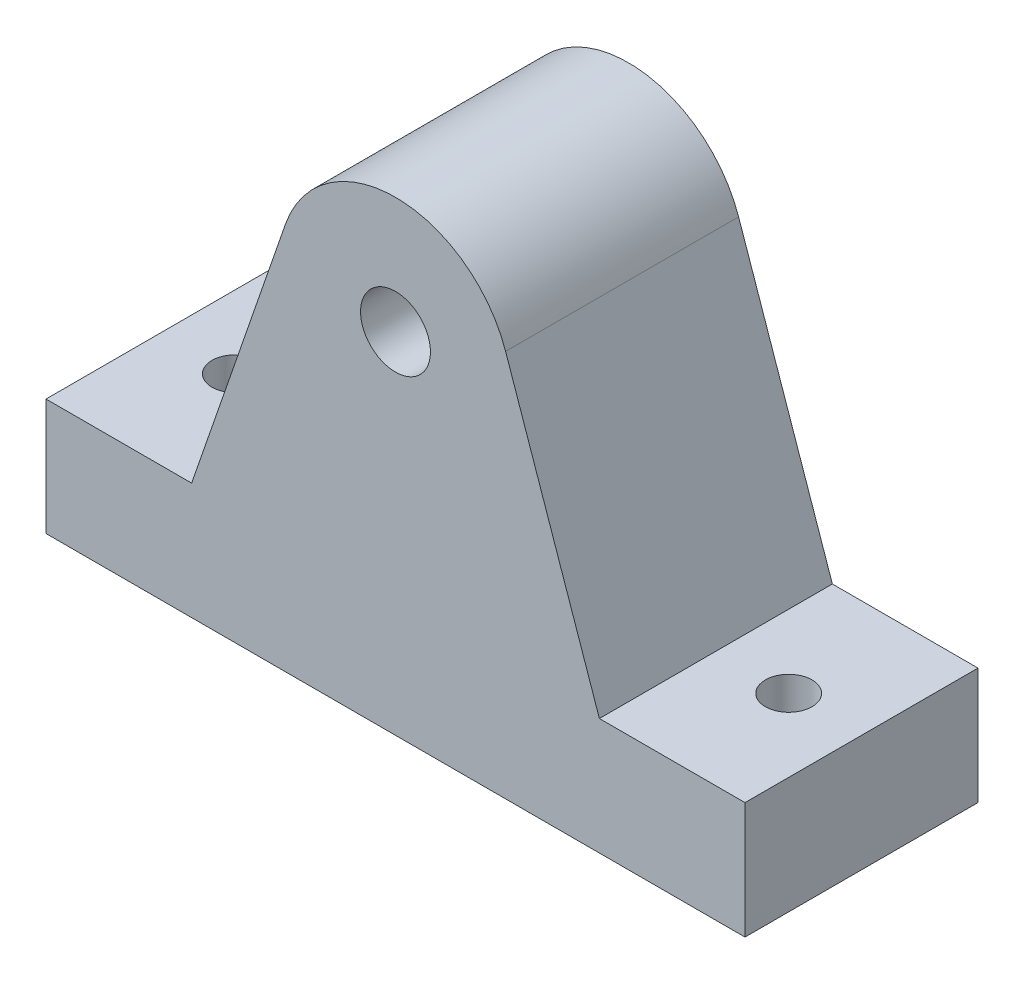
ISO-10303-21;
HEADER;
FILE_DESCRIPTION(('STEP AP214'),'2;1');
FILE_NAME('part.step','',(''),(''),'','','');
FILE_SCHEMA(('AUTOMOTIVE_DESIGN { 1 0 10303 214 1 1 1 1 }'));
ENDSEC;
DATA;
#1=APPLICATION_CONTEXT('core data for automotive mechanical design processes');
#2=APPLICATION_PROTOCOL_DEFINITION('international standard','automotive_design',2000,#1);
#3=PRODUCT_CONTEXT('',#1,'mechanical');
#4=PRODUCT('Part','Part','',(#3));
#5=PRODUCT_RELATED_PRODUCT_CATEGORY('part','',(#4));
#6=PRODUCT_DEFINITION_FORMATION('','',#4);
#7=PRODUCT_DEFINITION_CONTEXT('part definition',#1,'design');
#8=PRODUCT_DEFINITION('design','',#6,#7);
#9=PRODUCT_DEFINITION_SHAPE('','',#8);
#10=(LENGTH_UNIT() NAMED_UNIT(*) SI_UNIT(.MILLI.,.METRE.));
#11=(NAMED_UNIT(*) PLANE_ANGLE_UNIT() SI_UNIT($,.RADIAN.));
#12=(NAMED_UNIT(*) SI_UNIT($,.STERADIAN.) SOLID_ANGLE_UNIT());
#13=UNCERTAINTY_MEASURE_WITH_UNIT(LENGTH_MEASURE(1.E-05),#10,'distance_accuracy_value','');
#14=(GEOMETRIC_REPRESENTATION_CONTEXT(3) GLOBAL_UNCERTAINTY_ASSIGNED_CONTEXT((#13)) GLOBAL_UNIT_ASSIGNED_CONTEXT((#10,
#11,#12)) REPRESENTATION_CONTEXT('',''));
#15=CARTESIAN_POINT('',(0.,0.,0.));
#16=DIRECTION('',(0.,0.,1.));
#17=DIRECTION('',(1.,0.,0.));
#18=AXIS2_PLACEMENT_3D('',#15,#16,#17);
#19=CARTESIAN_POINT('',(0.,30.,20.));
#20=DIRECTION('',(0.,0.,1.));
#21=DIRECTION('',(1.,0.,0.));
#22=AXIS2_PLACEMENT_3D('',#19,#20,#21);
#23=PLANE('',#22);
#24=DIRECTION('',(-1.,0.,0.));
#25=VECTOR('',#24,1.);
#26=CARTESIAN_POINT('',(-30.,10.,20.));
#27=LINE('',#26,#25);
#28=CARTESIAN_POINT('',(-17.5,10.,20.));
#29=VERTEX_POINT('',#28);
#30=CARTESIAN_POINT('',(-30.,10.,20.));
#31=VERTEX_POINT('',#30);
#32=EDGE_CURVE('E145',#29,#31,#27,.T.);
#33=ORIENTED_EDGE('',*,*,#32,.T.);
#34=DIRECTION('',(0.,-1.,0.));
#35=VECTOR('',#34,1.);
#36=CARTESIAN_POINT('',(-30.,0.,20.));
#37=LINE('',#36,#35);
#38=CARTESIAN_POINT('',(-30.,0.,20.));
#39=VERTEX_POINT('',#38);
#40=EDGE_CURVE('E93',#31,#39,#37,.T.);
#41=ORIENTED_EDGE('',*,*,#40,.T.);
#42=DIRECTION('',(1.,0.,0.));
#43=VECTOR('',#42,1.);
#44=CARTESIAN_POINT('',(-30.,0.,20.));
#45=LINE('',#44,#43);
#46=CARTESIAN_POINT('',(30.,0.,20.));
#47=VERTEX_POINT('',#46);
#48=EDGE_CURVE('E160',#39,#47,#45,.T.);
#49=ORIENTED_EDGE('',*,*,#48,.T.);
#50=DIRECTION('',(0.,1.,0.));
#51=VECTOR('',#50,1.);
#52=CARTESIAN_POINT('',(30.,0.,20.));
#53=LINE('',#52,#51);
#54=CARTESIAN_POINT('',(30.,10.,20.));
#55=VERTEX_POINT('',#54);
#56=EDGE_CURVE('E173',#47,#55,#53,.T.);
#57=ORIENTED_EDGE('',*,*,#56,.T.);
#58=DIRECTION('',(-1.,0.,0.));
#59=VECTOR('',#58,1.);
#60=CARTESIAN_POINT('',(30.,10.,20.));
#61=LINE('',#60,#59);
#62=CARTESIAN_POINT('',(17.5,10.,20.));
#63=VERTEX_POINT('',#62);
#64=EDGE_CURVE('E112',#55,#63,#61,.T.);
#65=ORIENTED_EDGE('',*,*,#64,.T.);
#66=DIRECTION('',(-0.326920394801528,0.945051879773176,0.));
#67=VECTOR('',#66,1.);
#68=CARTESIAN_POINT('',(17.5,10.,20.));
#69=LINE('',#68,#67);
#70=CARTESIAN_POINT('',(9.45051879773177,33.2692039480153,20.));
#71=VERTEX_POINT('',#70);
#72=EDGE_CURVE('E106',#63,#71,#69,.T.);
#73=ORIENTED_EDGE('',*,*,#72,.T.);
#74=CARTESIAN_POINT('',(0.,30.,20.));
#75=DIRECTION('',(0.,0.,1.));
#76=DIRECTION('',(1.,0.,0.));
#77=AXIS2_PLACEMENT_3D('',#74,#75,#76);
#78=CIRCLE('',#77,10.);
#79=CARTESIAN_POINT('',(-9.45051879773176,33.2692039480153,20.));
#80=VERTEX_POINT('',#79);
#81=EDGE_CURVE('E110',#71,#80,#78,.T.);
#82=ORIENTED_EDGE('',*,*,#81,.T.);
#83=DIRECTION('',(-0.326920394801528,-0.945051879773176,0.));
#84=VECTOR('',#83,1.);
#85=CARTESIAN_POINT('',(-17.5,10.,20.));
#86=LINE('',#85,#84);
#87=EDGE_CURVE('E50',#80,#29,#86,.T.);
#88=ORIENTED_EDGE('',*,*,#87,.T.);
#89=EDGE_LOOP('',(#33,#41,#49,#57,#65,#73,#82,#88));
#90=FACE_BOUND('',#89,.T.);
#91=CARTESIAN_POINT('',(0.,30.,20.));
#92=DIRECTION('',(0.,0.,1.));
#93=DIRECTION('',(1.,0.,0.));
#94=AXIS2_PLACEMENT_3D('',#91,#92,#93);
#95=CIRCLE('',#94,3.);
#96=CARTESIAN_POINT('',(3.,30.,20.));
#97=VERTEX_POINT('',#96);
#98=EDGE_CURVE('E134',#97,#97,#95,.T.);
#99=ORIENTED_EDGE('',*,*,#98,.F.);
#100=EDGE_LOOP('',(#99));
#101=FACE_BOUND('',#100,.T.);
#102=ADVANCED_FACE('F33',(#90,#101),#23,.T.);
#103=CARTESIAN_POINT('',(0.,30.,0.));
#104=DIRECTION('',(0.,0.,1.));
#105=DIRECTION('',(1.,0.,0.));
#106=AXIS2_PLACEMENT_3D('',#103,#104,#105);
#107=PLANE('',#106);
#108=DIRECTION('',(-1.,0.,0.));
#109=VECTOR('',#108,1.);
#110=CARTESIAN_POINT('',(-30.,10.,0.));
#111=LINE('',#110,#109);
#112=CARTESIAN_POINT('',(-17.5,10.,0.));
#113=VERTEX_POINT('',#112);
#114=CARTESIAN_POINT('',(-30.,10.,0.));
#115=VERTEX_POINT('',#114);
#116=EDGE_CURVE('E130',#113,#115,#111,.T.);
#117=ORIENTED_EDGE('',*,*,#116,.F.);
#118=DIRECTION('',(-0.326920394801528,-0.945051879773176,0.));
#119=VECTOR('',#118,1.);
#120=CARTESIAN_POINT('',(-17.5,10.,0.));
#121=LINE('',#120,#119);
#122=CARTESIAN_POINT('',(-9.45051879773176,33.2692039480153,0.));
#123=VERTEX_POINT('',#122);
#124=EDGE_CURVE('E85',#123,#113,#121,.T.);
#125=ORIENTED_EDGE('',*,*,#124,.F.);
#126=CARTESIAN_POINT('',(0.,30.,0.));
#127=DIRECTION('',(0.,0.,1.));
#128=DIRECTION('',(1.,0.,0.));
#129=AXIS2_PLACEMENT_3D('',#126,#127,#128);
#130=CIRCLE('',#129,10.);
#131=CARTESIAN_POINT('',(9.45051879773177,33.2692039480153,0.));
#132=VERTEX_POINT('',#131);
#133=EDGE_CURVE('E79',#132,#123,#130,.T.);
#134=ORIENTED_EDGE('',*,*,#133,.F.);
#135=DIRECTION('',(-0.326920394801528,0.945051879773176,0.));
#136=VECTOR('',#135,1.);
#137=CARTESIAN_POINT('',(17.5,10.,0.));
#138=LINE('',#137,#136);
#139=CARTESIAN_POINT('',(17.5,10.,0.));
#140=VERTEX_POINT('',#139);
#141=EDGE_CURVE('E120',#140,#132,#138,.T.);
#142=ORIENTED_EDGE('',*,*,#141,.F.);
#143=DIRECTION('',(-1.,0.,0.));
#144=VECTOR('',#143,1.);
#145=CARTESIAN_POINT('',(30.,10.,0.));
#146=LINE('',#145,#144);
#147=CARTESIAN_POINT('',(30.,10.,0.));
#148=VERTEX_POINT('',#147);
#149=EDGE_CURVE('E140',#148,#140,#146,.T.);
#150=ORIENTED_EDGE('',*,*,#149,.F.);
#151=DIRECTION('',(0.,1.,0.));
#152=VECTOR('',#151,1.);
#153=CARTESIAN_POINT('',(30.,0.,0.));
#154=LINE('',#153,#152);
#155=CARTESIAN_POINT('',(30.,0.,0.));
#156=VERTEX_POINT('',#155);
#157=EDGE_CURVE('E138',#156,#148,#154,.T.);
#158=ORIENTED_EDGE('',*,*,#157,.F.);
#159=DIRECTION('',(1.,0.,0.));
#160=VECTOR('',#159,1.);
#161=CARTESIAN_POINT('',(-30.,0.,0.));
#162=LINE('',#161,#160);
#163=CARTESIAN_POINT('',(-30.,0.,0.));
#164=VERTEX_POINT('',#163);
#165=EDGE_CURVE('E136',#164,#156,#162,.T.);
#166=ORIENTED_EDGE('',*,*,#165,.F.);
#167=DIRECTION('',(0.,-1.,0.));
#168=VECTOR('',#167,1.);
#169=CARTESIAN_POINT('',(-30.,0.,0.));
#170=LINE('',#169,#168);
#171=EDGE_CURVE('E133',#115,#164,#170,.T.);
#172=ORIENTED_EDGE('',*,*,#171,.F.);
#173=EDGE_LOOP('',(#117,#125,#134,#142,#150,#158,#166,#172));
#174=FACE_BOUND('',#173,.T.);
#175=CARTESIAN_POINT('',(0.,30.,0.));
#176=DIRECTION('',(0.,0.,1.));
#177=DIRECTION('',(1.,0.,0.));
#178=AXIS2_PLACEMENT_3D('',#175,#176,#177);
#179=CIRCLE('',#178,3.);
#180=CARTESIAN_POINT('',(3.,30.,0.));
#181=VERTEX_POINT('',#180);
#182=EDGE_CURVE('E179',#181,#181,#179,.T.);
#183=ORIENTED_EDGE('',*,*,#182,.T.);
#184=EDGE_LOOP('',(#183));
#185=FACE_BOUND('',#184,.T.);
#186=ADVANCED_FACE('F164',(#174,#185),#107,.F.);
#187=CARTESIAN_POINT('',(-30.,10.,20.));
#188=DIRECTION('',(0.,-1.,0.));
#189=DIRECTION('',(1.,0.,0.));
#190=AXIS2_PLACEMENT_3D('',#187,#188,#189);
#191=PLANE('',#190);
#192=CARTESIAN_POINT('',(-23.75,10.,10.));
#193=DIRECTION('',(0.,1.,0.));
#194=DIRECTION('',(-1.,0.,0.));
#195=AXIS2_PLACEMENT_3D('',#192,#193,#194);
#196=CIRCLE('',#195,2.);
#197=CARTESIAN_POINT('',(-25.75,10.,10.));
#198=VERTEX_POINT('',#197);
#199=EDGE_CURVE('E191',#198,#198,#196,.T.);
#200=ORIENTED_EDGE('',*,*,#199,.F.);
#201=EDGE_LOOP('',(#200));
#202=FACE_BOUND('',#201,.T.);
#203=ORIENTED_EDGE('',*,*,#116,.T.);
#204=DIRECTION('',(0.,0.,-1.));
#205=VECTOR('',#204,1.);
#206=CARTESIAN_POINT('',(-30.,10.,20.));
#207=LINE('',#206,#205);
#208=EDGE_CURVE('E11',#31,#115,#207,.T.);
#209=ORIENTED_EDGE('',*,*,#208,.F.);
#210=ORIENTED_EDGE('',*,*,#32,.F.);
#211=DIRECTION('',(0.,0.,-1.));
#212=VECTOR('',#211,1.);
#213=CARTESIAN_POINT('',(-17.5,10.,20.));
#214=LINE('',#213,#212);
#215=EDGE_CURVE('E126',#29,#113,#214,.T.);
#216=ORIENTED_EDGE('',*,*,#215,.T.);
#217=EDGE_LOOP('',(#203,#209,#210,#216));
#218=FACE_BOUND('',#217,.T.);
#219=ADVANCED_FACE('F35',(#202,#218),#191,.F.);
#220=CARTESIAN_POINT('',(-30.,0.,20.));
#221=DIRECTION('',(1.,0.,0.));
#222=DIRECTION('',(0.,0.,-1.));
#223=AXIS2_PLACEMENT_3D('',#220,#221,#222);
#224=PLANE('',#223);
#225=ORIENTED_EDGE('',*,*,#171,.T.);
#226=DIRECTION('',(0.,0.,-1.));
#227=VECTOR('',#226,1.);
#228=CARTESIAN_POINT('',(-30.,0.,20.));
#229=LINE('',#228,#227);
#230=EDGE_CURVE('E42',#39,#164,#229,.T.);
#231=ORIENTED_EDGE('',*,*,#230,.F.);
#232=ORIENTED_EDGE('',*,*,#40,.F.);
#233=ORIENTED_EDGE('',*,*,#208,.T.);
#234=EDGE_LOOP('',(#225,#231,#232,#233));
#235=FACE_BOUND('',#234,.T.);
#236=ADVANCED_FACE('F208',(#235),#224,.F.);
#237=CARTESIAN_POINT('',(-30.,0.,20.));
#238=DIRECTION('',(0.,1.,0.));
#239=DIRECTION('',(0.,0.,1.));
#240=AXIS2_PLACEMENT_3D('',#237,#238,#239);
#241=PLANE('',#240);
#242=CARTESIAN_POINT('',(-23.75,0.,10.));
#243=DIRECTION('',(0.,1.,0.));
#244=DIRECTION('',(-1.,0.,0.));
#245=AXIS2_PLACEMENT_3D('',#242,#243,#244);
#246=CIRCLE('',#245,2.);
#247=CARTESIAN_POINT('',(-25.75,0.,10.));
#248=VERTEX_POINT('',#247);
#249=EDGE_CURVE('E182',#248,#248,#246,.T.);
#250=ORIENTED_EDGE('',*,*,#249,.T.);
#251=EDGE_LOOP('',(#250));
#252=FACE_BOUND('',#251,.T.);
#253=CARTESIAN_POINT('',(23.75,0.,10.));
#254=DIRECTION('',(0.,1.,0.));
#255=DIRECTION('',(1.,0.,0.));
#256=AXIS2_PLACEMENT_3D('',#253,#254,#255);
#257=CIRCLE('',#256,2.);
#258=CARTESIAN_POINT('',(25.75,0.,10.));
#259=VERTEX_POINT('',#258);
#260=EDGE_CURVE('E188',#259,#259,#257,.T.);
#261=ORIENTED_EDGE('',*,*,#260,.T.);
#262=EDGE_LOOP('',(#261));
#263=FACE_BOUND('',#262,.T.);
#264=ORIENTED_EDGE('',*,*,#165,.T.);
#265=DIRECTION('',(0.,0.,-1.));
#266=VECTOR('',#265,1.);
#267=CARTESIAN_POINT('',(30.,0.,20.));
#268=LINE('',#267,#266);
#269=EDGE_CURVE('E152',#47,#156,#268,.T.);
#270=ORIENTED_EDGE('',*,*,#269,.F.);
#271=ORIENTED_EDGE('',*,*,#48,.F.);
#272=ORIENTED_EDGE('',*,*,#230,.T.);
#273=EDGE_LOOP('',(#264,#270,#271,#272));
#274=FACE_BOUND('',#273,.T.);
#275=ADVANCED_FACE('F158',(#252,#263,#274),#241,.F.);
#276=CARTESIAN_POINT('',(30.,0.,20.));
#277=DIRECTION('',(-1.,0.,0.));
#278=DIRECTION('',(0.,0.,1.));
#279=AXIS2_PLACEMENT_3D('',#276,#277,#278);
#280=PLANE('',#279);
#281=ORIENTED_EDGE('',*,*,#157,.T.);
#282=DIRECTION('',(0.,0.,-1.));
#283=VECTOR('',#282,1.);
#284=CARTESIAN_POINT('',(30.,10.,20.));
#285=LINE('',#284,#283);
#286=EDGE_CURVE('E149',#55,#148,#285,.T.);
#287=ORIENTED_EDGE('',*,*,#286,.F.);
#288=ORIENTED_EDGE('',*,*,#56,.F.);
#289=ORIENTED_EDGE('',*,*,#269,.T.);
#290=EDGE_LOOP('',(#281,#287,#288,#289));
#291=FACE_BOUND('',#290,.T.);
#292=ADVANCED_FACE('F169',(#291),#280,.F.);
#293=CARTESIAN_POINT('',(30.,10.,20.));
#294=DIRECTION('',(0.,-1.,0.));
#295=DIRECTION('',(1.,0.,0.));
#296=AXIS2_PLACEMENT_3D('',#293,#294,#295);
#297=PLANE('',#296);
#298=CARTESIAN_POINT('',(23.75,10.,10.));
#299=DIRECTION('',(0.,1.,0.));
#300=DIRECTION('',(1.,0.,0.));
#301=AXIS2_PLACEMENT_3D('',#298,#299,#300);
#302=CIRCLE('',#301,2.);
#303=CARTESIAN_POINT('',(25.75,10.,10.));
#304=VERTEX_POINT('',#303);
#305=EDGE_CURVE('E185',#304,#304,#302,.T.);
#306=ORIENTED_EDGE('',*,*,#305,.F.);
#307=EDGE_LOOP('',(#306));
#308=FACE_BOUND('',#307,.T.);
#309=ORIENTED_EDGE('',*,*,#149,.T.);
#310=DIRECTION('',(0.,0.,-1.));
#311=VECTOR('',#310,1.);
#312=CARTESIAN_POINT('',(17.5,10.,20.));
#313=LINE('',#312,#311);
#314=EDGE_CURVE('E121',#63,#140,#313,.T.);
#315=ORIENTED_EDGE('',*,*,#314,.F.);
#316=ORIENTED_EDGE('',*,*,#64,.F.);
#317=ORIENTED_EDGE('',*,*,#286,.T.);
#318=EDGE_LOOP('',(#309,#315,#316,#317));
#319=FACE_BOUND('',#318,.T.);
#320=ADVANCED_FACE('F172',(#308,#319),#297,.F.);
#321=CARTESIAN_POINT('',(17.5,10.,20.));
#322=DIRECTION('',(-0.945051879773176,-0.326920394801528,0.));
#323=DIRECTION('',(0.326920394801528,-0.945051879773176,0.));
#324=AXIS2_PLACEMENT_3D('',#321,#322,#323);
#325=PLANE('',#324);
#326=ORIENTED_EDGE('',*,*,#141,.T.);
#327=DIRECTION('',(0.,0.,-1.));
#328=VECTOR('',#327,1.);
#329=CARTESIAN_POINT('',(9.45051879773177,33.2692039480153,20.));
#330=LINE('',#329,#328);
#331=EDGE_CURVE('E117',#71,#132,#330,.T.);
#332=ORIENTED_EDGE('',*,*,#331,.F.);
#333=ORIENTED_EDGE('',*,*,#72,.F.);
#334=ORIENTED_EDGE('',*,*,#314,.T.);
#335=EDGE_LOOP('',(#326,#332,#333,#334));
#336=FACE_BOUND('',#335,.T.);
#337=ADVANCED_FACE('F118',(#336),#325,.F.);
#338=CARTESIAN_POINT('',(0.,30.,20.));
#339=DIRECTION('',(0.,0.,-1.));
#340=DIRECTION('',(-1.,0.,0.));
#341=AXIS2_PLACEMENT_3D('',#338,#339,#340);
#342=CYLINDRICAL_SURFACE('',#341,10.);
#343=ORIENTED_EDGE('',*,*,#133,.T.);
#344=DIRECTION('',(0.,0.,-1.));
#345=VECTOR('',#344,1.);
#346=CARTESIAN_POINT('',(-9.45051879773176,33.2692039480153,20.));
#347=LINE('',#346,#345);
#348=EDGE_CURVE('E122',#80,#123,#347,.T.);
#349=ORIENTED_EDGE('',*,*,#348,.F.);
#350=ORIENTED_EDGE('',*,*,#81,.F.);
#351=ORIENTED_EDGE('',*,*,#331,.T.);
#352=EDGE_LOOP('',(#343,#349,#350,#351));
#353=FACE_BOUND('',#352,.T.);
#354=ADVANCED_FACE('F124',(#353),#342,.T.);
#355=CARTESIAN_POINT('',(-17.5,10.,20.));
#356=DIRECTION('',(0.945051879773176,-0.326920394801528,0.));
#357=DIRECTION('',(0.326920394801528,0.945051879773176,0.));
#358=AXIS2_PLACEMENT_3D('',#355,#356,#357);
#359=PLANE('',#358);
#360=ORIENTED_EDGE('',*,*,#124,.T.);
#361=ORIENTED_EDGE('',*,*,#215,.F.);
#362=ORIENTED_EDGE('',*,*,#87,.F.);
#363=ORIENTED_EDGE('',*,*,#348,.T.);
#364=EDGE_LOOP('',(#360,#361,#362,#363));
#365=FACE_BOUND('',#364,.T.);
#366=ADVANCED_FACE('F211',(#365),#359,.F.);
#367=CARTESIAN_POINT('',(0.,30.,20.));
#368=DIRECTION('',(0.,0.,-1.));
#369=DIRECTION('',(-1.,0.,0.));
#370=AXIS2_PLACEMENT_3D('',#367,#368,#369);
#371=CYLINDRICAL_SURFACE('',#370,3.);
#372=ORIENTED_EDGE('',*,*,#98,.T.);
#373=EDGE_LOOP('',(#372));
#374=FACE_BOUND('',#373,.T.);
#375=ORIENTED_EDGE('',*,*,#182,.F.);
#376=EDGE_LOOP('',(#375));
#377=FACE_BOUND('',#376,.T.);
#378=ADVANCED_FACE('F213',(#374,#377),#371,.F.);
#379=CARTESIAN_POINT('',(23.75,0.,10.));
#380=DIRECTION('',(0.,1.,0.));
#381=DIRECTION('',(-1.,0.,0.));
#382=AXIS2_PLACEMENT_3D('',#379,#380,#381);
#383=CYLINDRICAL_SURFACE('',#382,2.);
#384=ORIENTED_EDGE('',*,*,#260,.F.);
#385=EDGE_LOOP('',(#384));
#386=FACE_BOUND('',#385,.T.);
#387=ORIENTED_EDGE('',*,*,#305,.T.);
#388=EDGE_LOOP('',(#387));
#389=FACE_BOUND('',#388,.T.);
#390=ADVANCED_FACE('F202',(#386,#389),#383,.F.);
#391=CARTESIAN_POINT('',(-23.75,0.,10.));
#392=DIRECTION('',(0.,1.,0.));
#393=DIRECTION('',(-1.,0.,0.));
#394=AXIS2_PLACEMENT_3D('',#391,#392,#393);
#395=CYLINDRICAL_SURFACE('',#394,2.);
#396=ORIENTED_EDGE('',*,*,#249,.F.);
#397=EDGE_LOOP('',(#396));
#398=FACE_BOUND('',#397,.T.);
#399=ORIENTED_EDGE('',*,*,#199,.T.);
#400=EDGE_LOOP('',(#399));
#401=FACE_BOUND('',#400,.T.);
#402=ADVANCED_FACE('F199',(#398,#401),#395,.F.);
#403=CLOSED_SHELL('',(#102,#186,#219,#236,#275,#292,#320,#337,#354,#366,#378,#390,#402));
#404=MANIFOLD_SOLID_BREP('B2',#403);
#405=ADVANCED_BREP_SHAPE_REPRESENTATION('',(#18,#404),#14);
#406=SHAPE_DEFINITION_REPRESENTATION(#9,#405);
ENDSEC;
END-ISO-10303-21;
